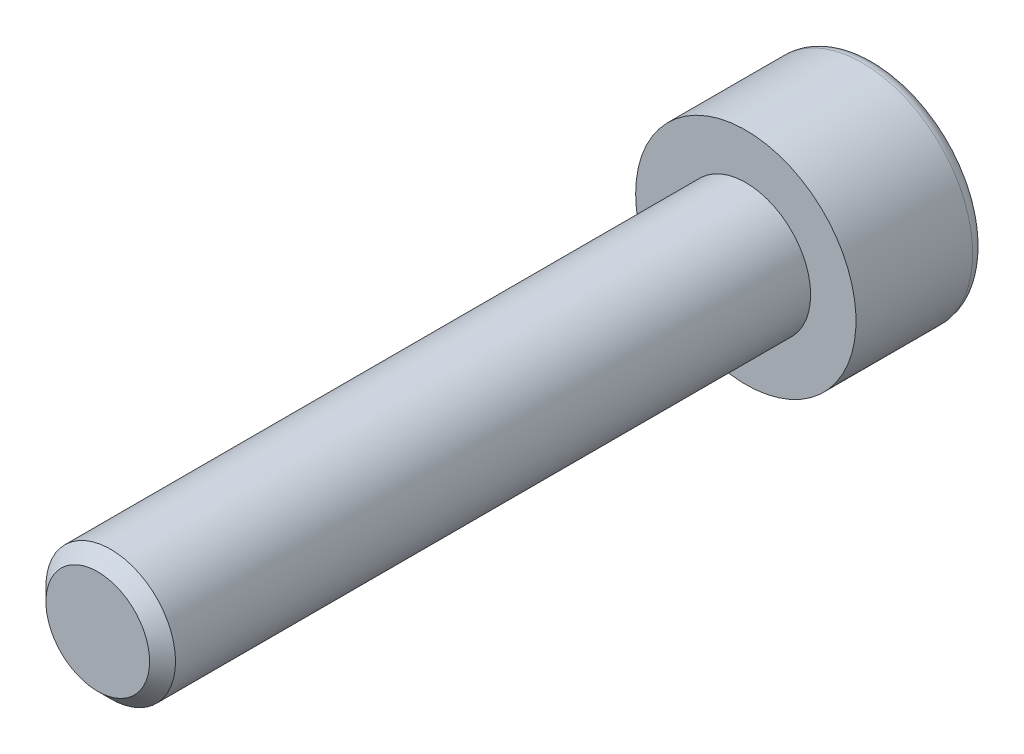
from build123d import *

# Parameters (mm, degrees)
ENLEV_MAT_EXTRU1_DEPTH = 2.5
ESQUISSE3_W            = 2.5
ESQUISSE3_H            = 25
CHANFREIN1_SIZE        = 0.5


with BuildPart() as part:
    # Esquisse1 → Base-R_volution (revolve)
    with BuildSketch(Plane(origin=(0, 0, 0), x_dir=(1, 0, 0), z_dir=(0, 1, 0)), mode=Mode.PRIVATE) as base_r_volution_sk:
        with BuildLine():
            Line((0, 0), (4.25, 0))
            Line((4.25, 0), (4.25, 4.5))
            ThreePointArc((4.25, 4.5), (4.103553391, 4.853553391), (3.75, 5))
            Line((3.75, 5), (0, 5))
            Line((0, 5), (0, 0))
        make_face()
    revolve(base_r_volution_sk.sketch.rotate(Axis((0, 0, 0), (0, 0, -1)), 180), axis=Axis((0, 0, 0), (0, 0, -1)))

    # Esquisse2 → enlev-mat-Extru1 (cut)
    with BuildSketch(Plane.XY.offset(-5)):
        Polygon((2, -1.154700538), (2, 1.154700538), (0, 2.309401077), (-2, 1.154700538), (-2, -1.154700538), (0, -2.309401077), align=None)
    extrude(amount=ENLEV_MAT_EXTRU1_DEPTH, mode=Mode.SUBTRACT)

    # Esquisse3 → Boss.-R_vol.1 (revolve)
    with BuildSketch(Plane(origin=(0, 0, 0), x_dir=(1, 0, 0), z_dir=(0, 1, 0))):
        with Locations((1.25, -12.5)):
            Rectangle(ESQUISSE3_W, ESQUISSE3_H)
    revolve(axis=Axis((0, 0, 0), (0, 0, 1)))

    # Chanfrein1
    chanfrein1_edges = [part.edges().sort_by_distance(p)[0] for p in [
        (-2.5, 0, 25),
    ]]
    chamfer(chanfrein1_edges, length=CHANFREIN1_SIZE)


solid = part.part
